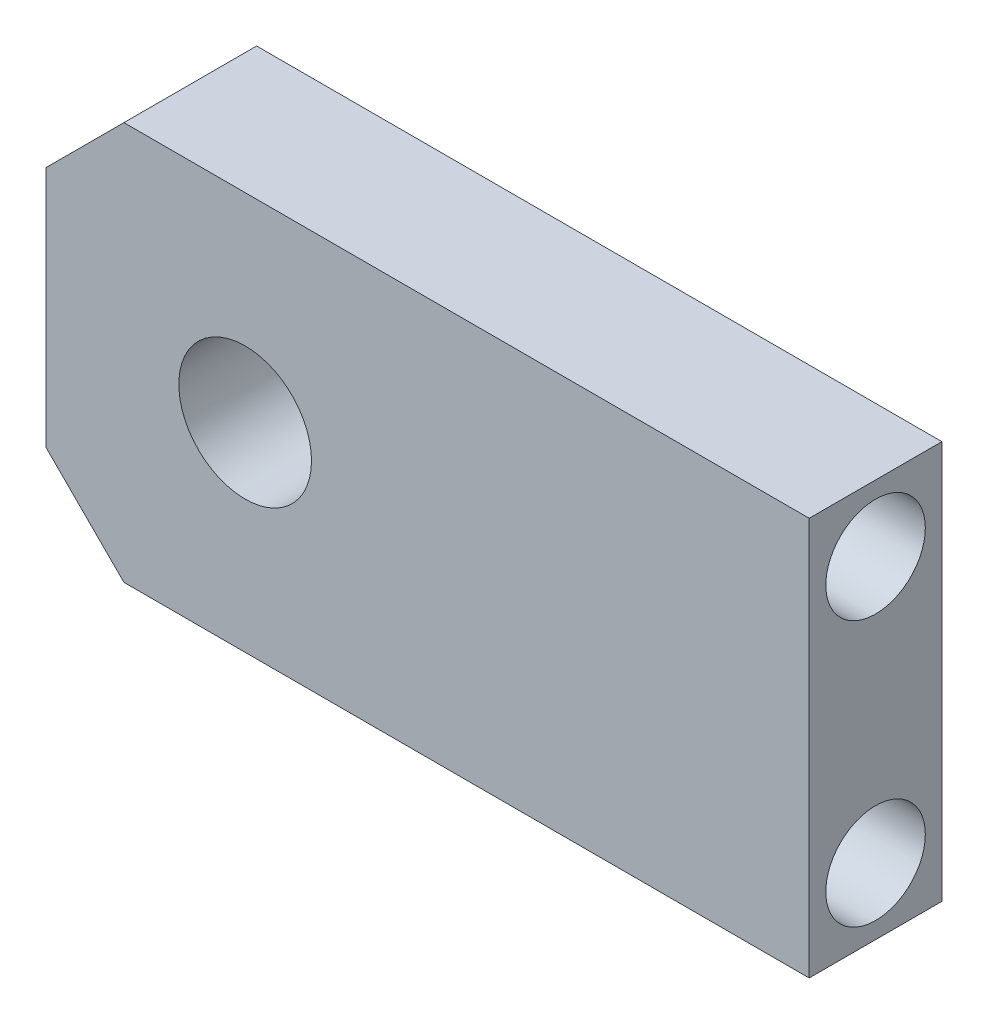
from build123d import *

# Parameters (mm, degrees)
BOSS_EXTRUDE1_DEPTH = 4
SKETCH2_R           = 1.5
CUT_EXTRUDE1_DEPTH  = 10
SKETCH4_R           = 2
CUT_EXTRUDE2_DEPTH  = 10


with BuildPart() as part:
    # Sketch1 → Boss-Extrude1 (new body)
    with BuildSketch(Plane.XY):
        Polygon((-13.943342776, -3.654390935), (-13.943342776, 3.654390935), (-11.597733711, 6), (9.056657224, 6), (9.056657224, -6), (-11.597733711, -6), align=None)
    extrude(amount=BOSS_EXTRUDE1_DEPTH)

    # Sketch2 → Cut-Extrude1 (cut)
    with BuildSketch(Plane(origin=(9.056657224, 0, 0), x_dir=(0, 0, -1), z_dir=(1, 0, 0))):
        with Locations((-2, 4)):
            Circle(SKETCH2_R)
        with Locations((-2, -4)):
            Circle(SKETCH2_R)
    extrude(amount=-CUT_EXTRUDE1_DEPTH, mode=Mode.SUBTRACT)

    # Sketch4 → Cut-Extrude2 (cut)
    with BuildSketch(Plane.XY.offset(4)):
        with Locations((-7.943342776, 0)):
            Circle(SKETCH4_R)
    extrude(amount=-CUT_EXTRUDE2_DEPTH, mode=Mode.SUBTRACT)


solid = part.part
